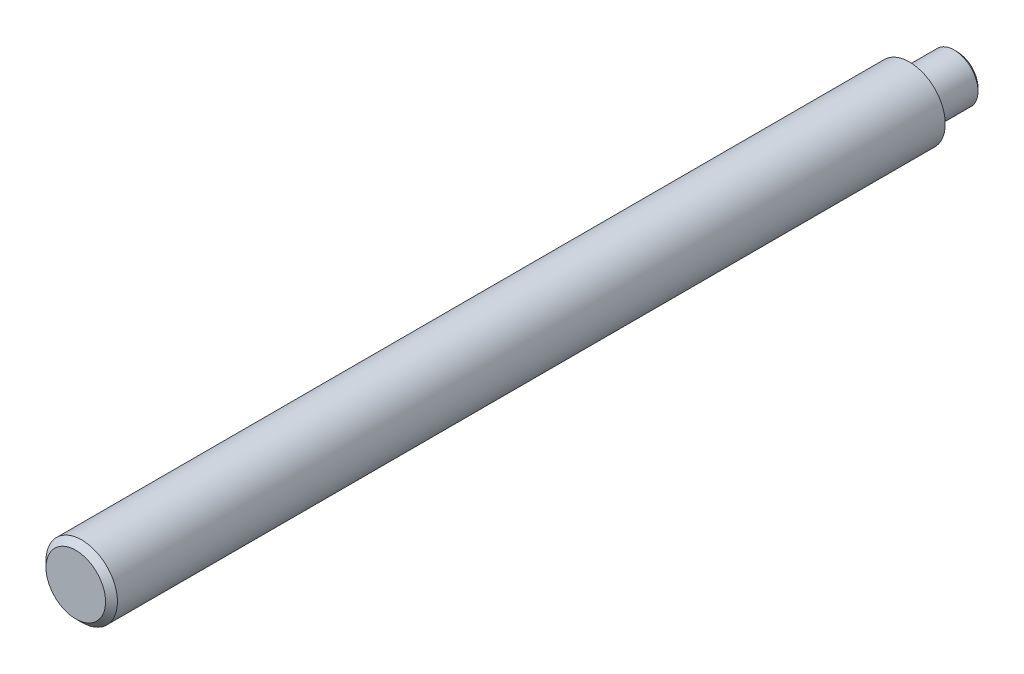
ISO-10303-21;
HEADER;
FILE_DESCRIPTION(('STEP AP214'),'2;1');
FILE_NAME('part.step','',(''),(''),'','','');
FILE_SCHEMA(('AUTOMOTIVE_DESIGN { 1 0 10303 214 1 1 1 1 }'));
ENDSEC;
DATA;
#1=APPLICATION_CONTEXT('core data for automotive mechanical design processes');
#2=APPLICATION_PROTOCOL_DEFINITION('international standard','automotive_design',2000,#1);
#3=PRODUCT_CONTEXT('',#1,'mechanical');
#4=PRODUCT('Part','Part','',(#3));
#5=PRODUCT_RELATED_PRODUCT_CATEGORY('part','',(#4));
#6=PRODUCT_DEFINITION_FORMATION('','',#4);
#7=PRODUCT_DEFINITION_CONTEXT('part definition',#1,'design');
#8=PRODUCT_DEFINITION('design','',#6,#7);
#9=PRODUCT_DEFINITION_SHAPE('','',#8);
#10=(LENGTH_UNIT() NAMED_UNIT(*) SI_UNIT(.MILLI.,.METRE.));
#11=(NAMED_UNIT(*) PLANE_ANGLE_UNIT() SI_UNIT($,.RADIAN.));
#12=(NAMED_UNIT(*) SI_UNIT($,.STERADIAN.) SOLID_ANGLE_UNIT());
#13=UNCERTAINTY_MEASURE_WITH_UNIT(LENGTH_MEASURE(1.E-05),#10,'distance_accuracy_value','');
#14=(GEOMETRIC_REPRESENTATION_CONTEXT(3) GLOBAL_UNCERTAINTY_ASSIGNED_CONTEXT((#13)) GLOBAL_UNIT_ASSIGNED_CONTEXT((#10,
#11,#12)) REPRESENTATION_CONTEXT('',''));
#15=CARTESIAN_POINT('',(0.,0.,0.));
#16=DIRECTION('',(0.,0.,1.));
#17=DIRECTION('',(1.,0.,0.));
#18=AXIS2_PLACEMENT_3D('',#15,#16,#17);
#19=CARTESIAN_POINT('',(0.,0.,-8.));
#20=DIRECTION('',(0.,0.,1.));
#21=DIRECTION('',(1.,0.,0.));
#22=AXIS2_PLACEMENT_3D('',#19,#20,#21);
#23=PLANE('',#22);
#24=CARTESIAN_POINT('',(0.,0.,-8.00000000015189));
#25=DIRECTION('',(0.,0.,1.));
#26=DIRECTION('',(1.,0.,0.));
#27=AXIS2_PLACEMENT_3D('',#24,#25,#26);
#28=CIRCLE('',#27,3.50000000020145);
#29=CARTESIAN_POINT('',(3.50000000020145,0.,-8.00000000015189));
#30=VERTEX_POINT('',#29);
#31=EDGE_CURVE('E16',#30,#30,#28,.T.);
#32=ORIENTED_EDGE('',*,*,#31,.F.);
#33=EDGE_LOOP('',(#32));
#34=FACE_BOUND('',#33,.T.);
#35=ADVANCED_FACE('F13',(#34),#23,.F.);
#36=CARTESIAN_POINT('',(0.,0.,-7.49999999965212));
#37=DIRECTION('',(0.,0.,1.));
#38=DIRECTION('',(1.,0.,0.));
#39=AXIS2_PLACEMENT_3D('',#36,#37,#38);
#40=CONICAL_SURFACE('',#39,3.99999999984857,0.785398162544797);
#41=CARTESIAN_POINT('',(0.,0.,-7.5));
#42=DIRECTION('',(0.,0.,-1.));
#43=DIRECTION('',(-1.,0.,0.));
#44=AXIS2_PLACEMENT_3D('',#41,#42,#43);
#45=CIRCLE('',#44,4.);
#46=CARTESIAN_POINT('',(-4.,0.,-7.5));
#47=VERTEX_POINT('',#46);
#48=EDGE_CURVE('E30',#47,#47,#45,.F.);
#49=ORIENTED_EDGE('',*,*,#48,.F.);
#50=EDGE_LOOP('',(#49));
#51=FACE_BOUND('',#50,.T.);
#52=ORIENTED_EDGE('',*,*,#31,.T.);
#53=EDGE_LOOP('',(#52));
#54=FACE_BOUND('',#53,.T.);
#55=ADVANCED_FACE('F46',(#51,#54),#40,.T.);
#56=CARTESIAN_POINT('',(0.,0.,0.));
#57=DIRECTION('',(0.,0.,-1.));
#58=DIRECTION('',(-1.,0.,0.));
#59=AXIS2_PLACEMENT_3D('',#56,#57,#58);
#60=CYLINDRICAL_SURFACE('',#59,4.);
#61=ORIENTED_EDGE('',*,*,#48,.T.);
#62=EDGE_LOOP('',(#61));
#63=FACE_BOUND('',#62,.T.);
#64=CARTESIAN_POINT('',(0.,0.,0.));
#65=DIRECTION('',(0.,0.,-1.));
#66=DIRECTION('',(-1.,0.,0.));
#67=AXIS2_PLACEMENT_3D('',#64,#65,#66);
#68=CIRCLE('',#67,4.);
#69=CARTESIAN_POINT('',(-4.,0.,0.));
#70=VERTEX_POINT('',#69);
#71=EDGE_CURVE('E33',#70,#70,#68,.F.);
#72=ORIENTED_EDGE('',*,*,#71,.F.);
#73=EDGE_LOOP('',(#72));
#74=FACE_BOUND('',#73,.T.);
#75=ADVANCED_FACE('F43',(#63,#74),#60,.T.);
#76=CARTESIAN_POINT('',(0.,0.,140.));
#77=DIRECTION('',(0.,0.,-1.));
#78=DIRECTION('',(-1.,0.,0.));
#79=AXIS2_PLACEMENT_3D('',#76,#77,#78);
#80=PLANE('',#79);
#81=CARTESIAN_POINT('',(0.,0.,140.000000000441));
#82=DIRECTION('',(0.,0.,-1.));
#83=DIRECTION('',(-1.,0.,0.));
#84=AXIS2_PLACEMENT_3D('',#81,#82,#83);
#85=CIRCLE('',#84,5.00000000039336);
#86=CARTESIAN_POINT('',(-5.00000000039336,0.,140.000000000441));
#87=VERTEX_POINT('',#86);
#88=EDGE_CURVE('E25',#87,#87,#85,.T.);
#89=ORIENTED_EDGE('',*,*,#88,.F.);
#90=EDGE_LOOP('',(#89));
#91=FACE_BOUND('',#90,.T.);
#92=ADVANCED_FACE('F45',(#91),#80,.F.);
#93=CARTESIAN_POINT('',(0.,0.,0.));
#94=DIRECTION('',(0.,0.,-1.));
#95=DIRECTION('',(-1.,0.,0.));
#96=AXIS2_PLACEMENT_3D('',#93,#94,#95);
#97=PLANE('',#96);
#98=ORIENTED_EDGE('',*,*,#71,.T.);
#99=EDGE_LOOP('',(#98));
#100=FACE_BOUND('',#99,.T.);
#101=CARTESIAN_POINT('',(0.,0.,0.));
#102=DIRECTION('',(0.,0.,1.));
#103=DIRECTION('',(1.,0.,0.));
#104=AXIS2_PLACEMENT_3D('',#101,#102,#103);
#105=CIRCLE('',#104,6.);
#106=CARTESIAN_POINT('',(6.,0.,0.));
#107=VERTEX_POINT('',#106);
#108=EDGE_CURVE('E20',#107,#107,#105,.T.);
#109=ORIENTED_EDGE('',*,*,#108,.F.);
#110=EDGE_LOOP('',(#109));
#111=FACE_BOUND('',#110,.T.);
#112=ADVANCED_FACE('F40',(#100,#111),#97,.T.);
#113=CARTESIAN_POINT('',(0.,0.,138.999999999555));
#114=DIRECTION('',(0.,0.,-1.));
#115=DIRECTION('',(-1.,0.,0.));
#116=AXIS2_PLACEMENT_3D('',#113,#114,#115);
#117=CONICAL_SURFACE('',#116,5.99999999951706,0.785398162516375);
#118=CARTESIAN_POINT('',(0.,0.,139.));
#119=DIRECTION('',(0.,0.,1.));
#120=DIRECTION('',(1.,0.,0.));
#121=AXIS2_PLACEMENT_3D('',#118,#119,#120);
#122=CIRCLE('',#121,6.);
#123=CARTESIAN_POINT('',(6.,0.,139.));
#124=VERTEX_POINT('',#123);
#125=EDGE_CURVE('E9',#124,#124,#122,.F.);
#126=ORIENTED_EDGE('',*,*,#125,.F.);
#127=EDGE_LOOP('',(#126));
#128=FACE_BOUND('',#127,.T.);
#129=ORIENTED_EDGE('',*,*,#88,.T.);
#130=EDGE_LOOP('',(#129));
#131=FACE_BOUND('',#130,.T.);
#132=ADVANCED_FACE('F59',(#128,#131),#117,.T.);
#133=CARTESIAN_POINT('',(0.,0.,0.));
#134=DIRECTION('',(0.,0.,1.));
#135=DIRECTION('',(1.,0.,0.));
#136=AXIS2_PLACEMENT_3D('',#133,#134,#135);
#137=CYLINDRICAL_SURFACE('',#136,6.);
#138=ORIENTED_EDGE('',*,*,#125,.T.);
#139=EDGE_LOOP('',(#138));
#140=FACE_BOUND('',#139,.T.);
#141=ORIENTED_EDGE('',*,*,#108,.T.);
#142=EDGE_LOOP('',(#141));
#143=FACE_BOUND('',#142,.T.);
#144=ADVANCED_FACE('F57',(#140,#143),#137,.T.);
#145=CLOSED_SHELL('',(#35,#55,#75,#92,#112,#132,#144));
#146=MANIFOLD_SOLID_BREP('B1',#145);
#147=ADVANCED_BREP_SHAPE_REPRESENTATION('',(#18,#146),#14);
#148=SHAPE_DEFINITION_REPRESENTATION(#9,#147);
ENDSEC;
END-ISO-10303-21;
